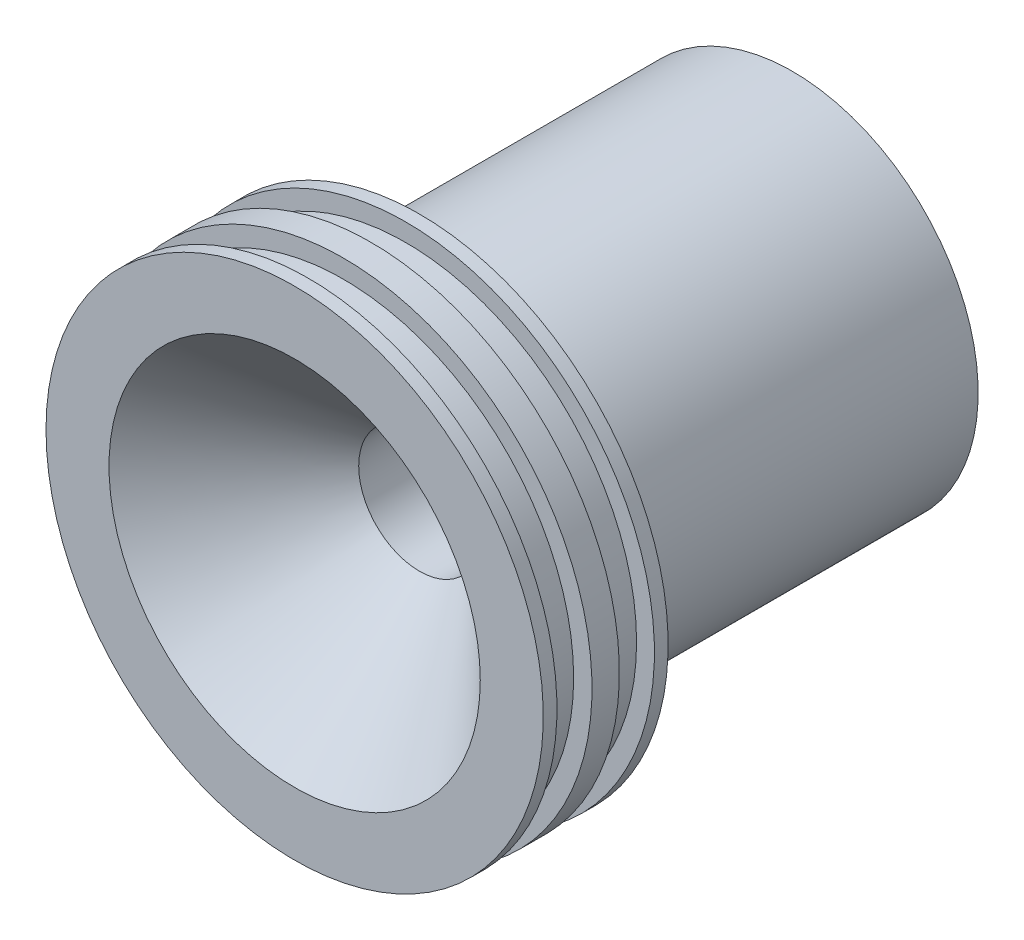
from build123d import *


with BuildPart() as part:
    # Sketch1 → Revolve1 (revolve)
    with BuildSketch(Plane.YZ, mode=Mode.PRIVATE) as revolve1_sk:
        Polygon((9.253474, 7.26694), (28.2575, 26.270966), (37.846, 26.270966), (37.846, 24.1869595), (35.052, 24.1869595), (35.052, 18.8529595), (37.846, 18.8529595), (37.846, 16.768953), (37.846, 14.6849465), (35.1282, 14.6849465), (35.1282, 9.3509465), (37.846, 9.3509465), (37.846, 7.26694), (28.2575, 7.26694), (28.2575, -49.5157182), (20.574, -49.5157182), (9.253474, -7.26694), align=None)
    revolve(revolve1_sk.sketch.rotate(Axis((0, 0, -87.464922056), (0, 0, 1)), 90), axis=Axis((0, 0, -87.464922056), (0, 0, 1)))


solid = part.part
